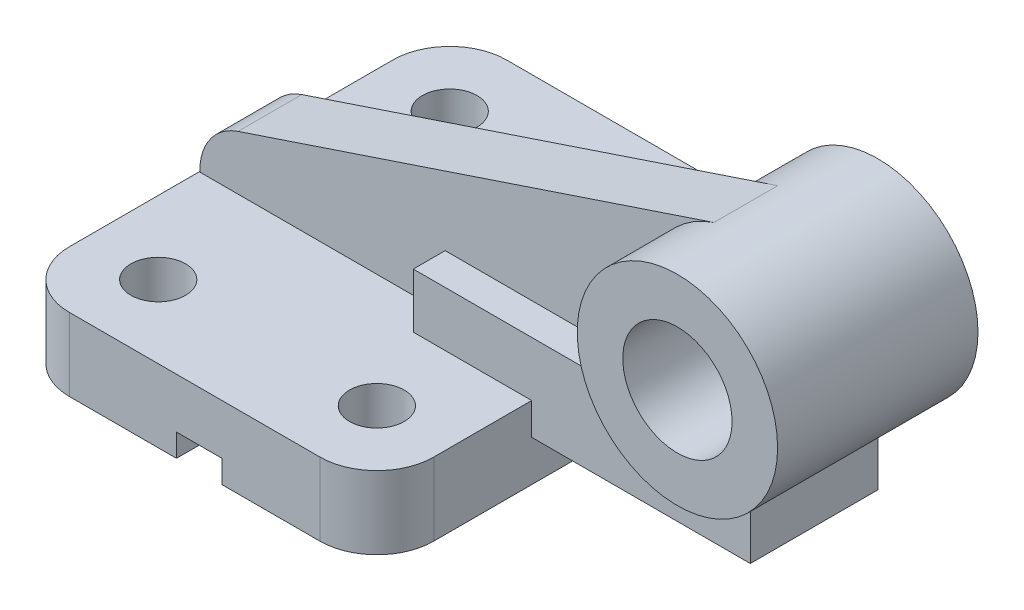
from build123d import *

# Parameters (mm, degrees)
EXTRUDE_1_DEPTH      = 44
EXTRUDE_1_DEPTH_BACK = 44
SKETCH_1_R           = 44
SKETCH_1_R_2         = 24
EXTRUDE_2_DEPTH      = 32
SKETCH_3_W           = 20
SKETCH_3_H           = 32.437061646
CUT_EXTRUDE_1_DEPTH  = 319.622033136
SKETCH_4_R           = 12
CUT_EXTRUDE_2_DEPTH  = 276.739007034
SKETCH_5_R           = 12
CUT_EXTRUDE_4_DEPTH  = 276.739007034
EXTRUDE_3_DEPTH      = 14
EXTRUDE_3_DEPTH_BACK = 14
EXTRUDE_4_DEPTH      = 28
EXTRUDE_4_DEPTH_BACK = 28


with BuildPart() as part:
    # Sketch 1 → Extrude 1 (new, two sides: drawn at the far end of the back side and taken through both)
    with BuildSketch(Plane.XY.offset(-EXTRUDE_1_DEPTH_BACK)):
        Circle(SKETCH_1_R)
        Circle(SKETCH_1_R_2, mode=Mode.SUBTRACT)
    extrude(amount=EXTRUDE_1_DEPTH + EXTRUDE_1_DEPTH_BACK)



with BuildPart() as body_2:
    # Sketch 2 → Extrude 2 (new body)
    with BuildSketch(Plane(origin=(0, -52, 0), x_dir=(-1, 0, 0), z_dir=(0, 1, 0))):
        with BuildLine():
            Line((80, -71), (80, 71))
            ThreePointArc((80, 71), (87.32233047, 88.67766953), (105, 96))
            Line((105, 96), (215, 96))
            ThreePointArc((215, 96), (232.67766953, 88.67766953), (240, 71))
            Line((240, 71), (240, -71))
            ThreePointArc((240, -71), (232.67766953, -88.67766953), (215, -96))
            Line((215, -96), (105, -96))
            ThreePointArc((105, -96), (87.32233047, -88.67766953), (80, -71))
        make_face()
    extrude(amount=-EXTRUDE_2_DEPTH)

    # Sketch 3 → Cut-Extrude 1 (cut, through all)
    with BuildSketch(Plane.XY.offset(96)):
        with Locations((-158, -90.218530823)):
            Rectangle(SKETCH_3_W, SKETCH_3_H)
    extrude(amount=-CUT_EXTRUDE_1_DEPTH, mode=Mode.SUBTRACT)

    # Sketch 4 → Cut-Extrude 2 (cut, through all)
    with BuildSketch(Plane(origin=(0, -52, 0), x_dir=(1, 0, 0), z_dir=(0, 1, 0))):
        with Locations(Location((-208, -64, 0), (0, 0, 270))):
            Circle(SKETCH_4_R)
    cut_extrude_2 = extrude(amount=-CUT_EXTRUDE_2_DEPTH, mode=Mode.SUBTRACT)

    # Mirror 1: Cut-Extrude 2 across plane
    add(cut_extrude_2.mirror(Plane.XY), mode=Mode.SUBTRACT)

    # Sketch 5 → Cut-Extrude 4 (cut, through all)
    with BuildSketch(Plane(origin=(0, -52, 0), x_dir=(1, 0, 0), z_dir=(0, 1, 0))):
        with Locations(Location((-112, -64, 0), (0, 0, 270))):
            Circle(SKETCH_5_R)
        with Locations(Location((-112, 64, 0), (0, 0, 270))):
            Circle(SKETCH_5_R)
    extrude(amount=-CUT_EXTRUDE_4_DEPTH, mode=Mode.SUBTRACT)

    # Sketch 9 → Extrude 3 (add, two sides: drawn at the far end of the back side and taken through both)
    with BuildSketch(Plane.XY.offset(-EXTRUDE_3_DEPTH_BACK)):
        with BuildLine():
            Line((-13.946941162, 41.731077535), (-222.963011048, -28.124171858))
            ThreePointArc((-222.963011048, -28.124171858), (-235.272008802, -37.302862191), (-239.716547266, -52))
            Line((-239.716547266, -52), (-132, -52))
            Line((-132, -52), (-132, -28))
            Line((-132, -28), (-44, -28))
            Line((-44, -28), (-44, 0))
            ThreePointArc((-44, 0), (-35.704799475, 25.713173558), (-13.946941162, 41.731077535))
        make_face()
    extrude(amount=EXTRUDE_3_DEPTH + EXTRUDE_3_DEPTH_BACK)


with BuildPart() as part_1:
    add(part.part)

    add(body_2.part)  # Extrude 4 merges body 2
    # Sketch 1_3 → Extrude 4 (add, two sides: drawn at the far end of the back side and taken through both)
    with BuildSketch(Plane.XY.offset(-EXTRUDE_4_DEPTH_BACK)):
        with BuildLine():
            ThreePointArc((16, -40.987803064), (-24.819347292, -36.331804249), (-44, 0))
            Line((-44, 0), (-44, -28))
            Line((-44, -28), (-132, -28))
            Line((-132, -28), (-132, -52))
            Line((-132, -52), (-80, -52))
            Line((-80, -52), (-80, -66))
            Line((-80, -66), (16, -66))
            Line((16, -66), (16, -40.987803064))
        make_face()
    extrude(amount=EXTRUDE_4_DEPTH + EXTRUDE_4_DEPTH_BACK)


solid = part_1.part
